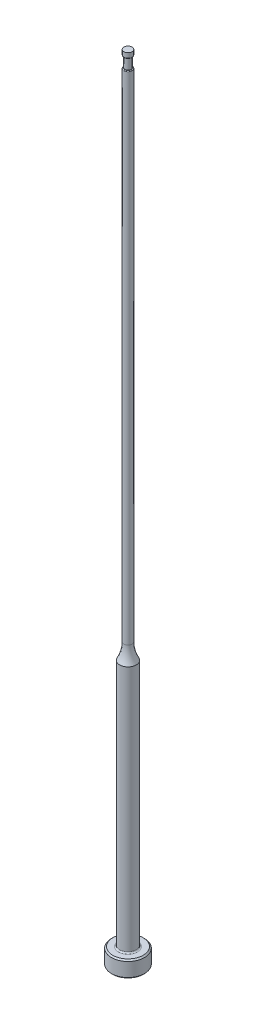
ISO-10303-21;
HEADER;
FILE_DESCRIPTION(('STEP AP214'),'2;1');
FILE_NAME('part.step','',(''),(''),'','','');
FILE_SCHEMA(('AUTOMOTIVE_DESIGN { 1 0 10303 214 1 1 1 1 }'));
ENDSEC;
DATA;
#1=APPLICATION_CONTEXT('core data for automotive mechanical design processes');
#2=APPLICATION_PROTOCOL_DEFINITION('international standard','automotive_design',2000,#1);
#3=PRODUCT_CONTEXT('',#1,'mechanical');
#4=PRODUCT('Part','Part','',(#3));
#5=PRODUCT_RELATED_PRODUCT_CATEGORY('part','',(#4));
#6=PRODUCT_DEFINITION_FORMATION('','',#4);
#7=PRODUCT_DEFINITION_CONTEXT('part definition',#1,'design');
#8=PRODUCT_DEFINITION('design','',#6,#7);
#9=PRODUCT_DEFINITION_SHAPE('','',#8);
#10=(LENGTH_UNIT() NAMED_UNIT(*) SI_UNIT(.MILLI.,.METRE.));
#11=(NAMED_UNIT(*) PLANE_ANGLE_UNIT() SI_UNIT($,.RADIAN.));
#12=(NAMED_UNIT(*) SI_UNIT($,.STERADIAN.) SOLID_ANGLE_UNIT());
#13=UNCERTAINTY_MEASURE_WITH_UNIT(LENGTH_MEASURE(1.E-05),#10,'distance_accuracy_value','');
#14=(GEOMETRIC_REPRESENTATION_CONTEXT(3) GLOBAL_UNCERTAINTY_ASSIGNED_CONTEXT((#13)) GLOBAL_UNIT_ASSIGNED_CONTEXT((#10,
#11,#12)) REPRESENTATION_CONTEXT('',''));
#15=CARTESIAN_POINT('',(0.,0.,0.));
#16=DIRECTION('',(0.,0.,1.));
#17=DIRECTION('',(1.,0.,0.));
#18=AXIS2_PLACEMENT_3D('',#15,#16,#17);
#19=CARTESIAN_POINT('',(-0.79374999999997,151.384,0.));
#20=DIRECTION('',(0.,1.,0.));
#21=DIRECTION('',(0.,0.,1.));
#22=AXIS2_PLACEMENT_3D('',#19,#20,#21);
#23=PLANE('',#22);
#24=CARTESIAN_POINT('',(0.,151.384,0.));
#25=DIRECTION('',(0.,1.,0.));
#26=DIRECTION('',(0.,0.,1.));
#27=AXIS2_PLACEMENT_3D('',#24,#25,#26);
#28=CIRCLE('',#27,0.66166999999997);
#29=CARTESIAN_POINT('',(0.,151.384,0.66166999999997));
#30=VERTEX_POINT('',#29);
#31=EDGE_CURVE('E11',#30,#30,#28,.F.);
#32=ORIENTED_EDGE('',*,*,#31,.T.);
#33=EDGE_LOOP('',(#32));
#34=FACE_BOUND('',#33,.T.);
#35=CARTESIAN_POINT('',(0.,151.384,0.));
#36=DIRECTION('',(0.,1.,0.));
#37=DIRECTION('',(0.,0.,1.));
#38=AXIS2_PLACEMENT_3D('',#35,#36,#37);
#39=CIRCLE('',#38,0.59054999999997);
#40=CARTESIAN_POINT('',(0.,151.384,0.59054999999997));
#41=VERTEX_POINT('',#40);
#42=EDGE_CURVE('E79',#41,#41,#39,.T.);
#43=ORIENTED_EDGE('',*,*,#42,.T.);
#44=EDGE_LOOP('',(#43));
#45=FACE_BOUND('',#44,.T.);
#46=ADVANCED_FACE('F37',(#34,#45),#23,.F.);
#47=CARTESIAN_POINT('',(0.,259.958771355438,0.));
#48=DIRECTION('',(0.,1.,0.));
#49=DIRECTION('',(0.,0.,1.));
#50=AXIS2_PLACEMENT_3D('',#47,#48,#49);
#51=CYLINDRICAL_SURFACE('',#50,0.79374999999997);
#52=DIRECTION('',(0.,1.,0.));
#53=VECTOR('',#52,1.);
#54=CARTESIAN_POINT('',(-0.590549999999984,259.958771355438,-0.530367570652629));
#55=LINE('',#54,#53);
#56=CARTESIAN_POINT('',(-0.590549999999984,149.225,-0.530367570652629));
#57=VERTEX_POINT('',#56);
#58=CARTESIAN_POINT('',(-0.590549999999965,112.268,-0.53036757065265));
#59=VERTEX_POINT('',#58);
#60=EDGE_CURVE('E74',#57,#59,#55,.F.);
#61=ORIENTED_EDGE('',*,*,#60,.F.);
#62=CARTESIAN_POINT('',(0.,149.225,0.));
#63=DIRECTION('',(0.,-1.,0.));
#64=DIRECTION('',(0.,0.,-1.));
#65=AXIS2_PLACEMENT_3D('',#62,#63,#64);
#66=CIRCLE('',#65,0.79374999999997);
#67=CARTESIAN_POINT('',(-0.590549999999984,149.225,0.530367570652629));
#68=VERTEX_POINT('',#67);
#69=EDGE_CURVE('E52',#57,#68,#66,.T.);
#70=ORIENTED_EDGE('',*,*,#69,.T.);
#71=DIRECTION('',(0.,1.,0.));
#72=VECTOR('',#71,1.);
#73=CARTESIAN_POINT('',(-0.590549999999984,259.958771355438,0.530367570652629));
#74=LINE('',#73,#72);
#75=CARTESIAN_POINT('',(-0.590549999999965,112.268,0.53036757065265));
#76=VERTEX_POINT('',#75);
#77=EDGE_CURVE('E85',#76,#68,#74,.T.);
#78=ORIENTED_EDGE('',*,*,#77,.F.);
#79=CARTESIAN_POINT('',(-0.590549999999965,112.268,-0.53036757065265));
#80=CARTESIAN_POINT('',(-0.590539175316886,112.212196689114,-0.530314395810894));
#81=CARTESIAN_POINT('',(-0.592020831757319,112.156372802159,-0.528725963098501));
#82=CARTESIAN_POINT('',(-0.597911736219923,112.044820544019,-0.522091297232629));
#83=CARTESIAN_POINT('',(-0.602334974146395,111.989093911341,-0.517028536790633));
#84=CARTESIAN_POINT('',(-0.614284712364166,111.876202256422,-0.502771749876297));
#85=CARTESIAN_POINT('',(-0.621928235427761,111.819068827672,-0.493420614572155));
#86=CARTESIAN_POINT('',(-0.640090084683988,111.706428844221,-0.469629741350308));
#87=CARTESIAN_POINT('',(-0.650601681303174,111.650918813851,-0.455201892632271));
#88=CARTESIAN_POINT('',(-0.672694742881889,111.548775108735,-0.421752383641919));
#89=CARTESIAN_POINT('',(-0.684015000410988,111.501853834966,-0.403447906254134));
#90=CARTESIAN_POINT('',(-0.707793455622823,111.411925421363,-0.360113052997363));
#91=CARTESIAN_POINT('',(-0.72023851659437,111.368882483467,-0.335155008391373));
#92=CARTESIAN_POINT('',(-0.738199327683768,111.310842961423,-0.292081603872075));
#93=CARTESIAN_POINT('',(-0.74383162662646,111.293242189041,-0.27753752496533));
#94=CARTESIAN_POINT('',(-0.754779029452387,111.259938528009,-0.246220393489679));
#95=CARTESIAN_POINT('',(-0.760093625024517,111.244238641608,-0.229443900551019));
#96=CARTESIAN_POINT('',(-0.77009609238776,111.215327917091,-0.193256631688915));
#97=CARTESIAN_POINT('',(-0.774774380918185,111.202154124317,-0.173812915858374));
#98=CARTESIAN_POINT('',(-0.7828791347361,111.179678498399,-0.13257215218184));
#99=CARTESIAN_POINT('',(-0.786309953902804,111.170363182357,-0.110783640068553));
#100=CARTESIAN_POINT('',(-0.790553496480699,111.158926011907,-0.0728220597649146));
#101=CARTESIAN_POINT('',(-0.791853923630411,111.155452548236,-0.057108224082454));
#102=CARTESIAN_POINT('',(-0.793506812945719,111.151044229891,-0.0252785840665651));
#103=CARTESIAN_POINT('',(-0.793859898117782,111.150107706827,-0.00916305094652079));
#104=CARTESIAN_POINT('',(-0.793579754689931,111.150852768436,0.0230049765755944));
#105=CARTESIAN_POINT('',(-0.792946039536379,111.152535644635,0.0390574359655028));
#106=CARTESIAN_POINT('',(-0.790759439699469,111.158380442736,0.0706385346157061));
#107=CARTESIAN_POINT('',(-0.789205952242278,111.162543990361,0.0861668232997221));
#108=CARTESIAN_POINT('',(-0.784847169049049,111.174343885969,0.120053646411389));
#109=CARTESIAN_POINT('',(-0.781828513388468,111.18258090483,0.138174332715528));
#110=CARTESIAN_POINT('',(-0.774926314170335,111.201745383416,0.172744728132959));
#111=CARTESIAN_POINT('',(-0.771041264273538,111.21267753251,0.189191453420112));
#112=CARTESIAN_POINT('',(-0.760742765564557,111.242279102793,0.227766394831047));
#113=CARTESIAN_POINT('',(-0.754005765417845,111.262155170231,0.24887506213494));
#114=CARTESIAN_POINT('',(-0.740079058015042,111.30484818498,0.287657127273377));
#115=CARTESIAN_POINT('',(-0.732888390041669,111.32767148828,0.305322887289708));
#116=CARTESIAN_POINT('',(-0.713188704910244,111.39302595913,0.349810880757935));
#117=CARTESIAN_POINT('',(-0.700707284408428,111.437575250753,0.373653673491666));
#118=CARTESIAN_POINT('',(-0.67715396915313,111.529937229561,0.414797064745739));
#119=CARTESIAN_POINT('',(-0.666086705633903,111.577759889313,0.432076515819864));
#120=CARTESIAN_POINT('',(-0.646811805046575,111.671193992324,0.460367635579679));
#121=CARTESIAN_POINT('',(-0.638441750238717,111.716651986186,0.471784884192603));
#122=CARTESIAN_POINT('',(-0.623612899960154,111.80862035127,0.491217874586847));
#123=CARTESIAN_POINT('',(-0.617155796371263,111.855131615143,0.499230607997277));
#124=CARTESIAN_POINT('',(-0.606291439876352,111.94873683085,0.512368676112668));
#125=CARTESIAN_POINT('',(-0.601882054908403,111.995830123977,0.517497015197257));
#126=CARTESIAN_POINT('',(-0.595168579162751,112.090371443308,0.525204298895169));
#127=CARTESIAN_POINT('',(-0.592864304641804,112.137819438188,0.527783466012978));
#128=CARTESIAN_POINT('',(-0.591267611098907,112.199102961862,0.529567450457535));
#129=CARTESIAN_POINT('',(-0.590998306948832,112.212891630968,0.529867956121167));
#130=CARTESIAN_POINT('',(-0.590639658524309,112.240453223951,0.530267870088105));
#131=CARTESIAN_POINT('',(-0.590550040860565,112.254226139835,0.530367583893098));
#132=CARTESIAN_POINT('',(-0.590549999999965,112.268,0.530367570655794));
#133=B_SPLINE_CURVE_WITH_KNOTS('',3,(#79,#80,#81,#82,#83,#84,#85,#86,#87,#88,#89,#90,#91,#92,
#93,#94,#95,#96,#97,#98,#99,#100,#101,#102,#103,#104,#105,#106,#107,#108,#109,#110,#111,#112,
#113,#114,#115,#116,#117,#118,#119,#120,#121,#122,#123,#124,#125,#126,#127,#128,#129,#130,#131,
#132),.UNSPECIFIED.,.F.,.F.,(4,2,2,2,2,2,2,2,2,2,2,2,2,2,2,2,2,2,2,2,2,2,2,2,2,2,4),(0.,
0.167401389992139,0.335604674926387,0.510534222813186,0.685056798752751,0.839551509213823,
0.99243073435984,1.0628421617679,1.13336338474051,1.20485071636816,1.27608609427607,
1.32431373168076,1.3725096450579,1.42072932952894,1.46898064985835,1.52904518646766,
1.5892149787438,1.67801053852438,1.76700089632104,1.9222687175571,2.07803266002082,
2.22066560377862,2.3634243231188,2.50603406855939,2.64863136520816,2.6900134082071,
2.73133244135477),.UNSPECIFIED.);
#134=EDGE_CURVE('E82',#59,#76,#133,.T.);
#135=ORIENTED_EDGE('',*,*,#134,.F.);
#136=EDGE_LOOP('',(#61,#70,#78,#135));
#137=FACE_BOUND('',#136,.T.);
#138=CARTESIAN_POINT('',(0.,53.8741805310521,0.));
#139=DIRECTION('',(0.,1.,0.));
#140=DIRECTION('',(0.,0.,1.));
#141=AXIS2_PLACEMENT_3D('',#138,#139,#140);
#142=CIRCLE('',#141,0.79374999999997);
#143=CARTESIAN_POINT('',(0.,53.8741805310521,0.79374999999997));
#144=VERTEX_POINT('',#143);
#145=EDGE_CURVE('E108',#144,#144,#142,.T.);
#146=ORIENTED_EDGE('',*,*,#145,.T.);
#147=EDGE_LOOP('',(#146));
#148=FACE_BOUND('',#147,.T.);
#149=ADVANCED_FACE('F83',(#137,#148),#51,.T.);
#150=CARTESIAN_POINT('',(0.,53.8741805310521,0.));
#151=DIRECTION('',(0.,1.,0.));
#152=DIRECTION('',(0.,0.,1.));
#153=AXIS2_PLACEMENT_3D('',#150,#151,#152);
#154=TOROIDAL_SURFACE('',#153,7.14374999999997,6.35);
#155=CARTESIAN_POINT('',(0.,50.8,0.));
#156=DIRECTION('',(0.,1.,0.));
#157=DIRECTION('',(0.,0.,1.));
#158=AXIS2_PLACEMENT_3D('',#155,#156,#157);
#159=CIRCLE('',#158,1.58749999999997);
#160=CARTESIAN_POINT('',(0.,50.8,1.58749999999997));
#161=VERTEX_POINT('',#160);
#162=EDGE_CURVE('E105',#161,#161,#159,.T.);
#163=ORIENTED_EDGE('',*,*,#162,.T.);
#164=EDGE_LOOP('',(#163));
#165=FACE_BOUND('',#164,.T.);
#166=ORIENTED_EDGE('',*,*,#145,.F.);
#167=EDGE_LOOP('',(#166));
#168=FACE_BOUND('',#167,.T.);
#169=ADVANCED_FACE('F172',(#165,#168),#154,.F.);
#170=CARTESIAN_POINT('',(0.,259.958771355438,0.));
#171=DIRECTION('',(0.,1.,0.));
#172=DIRECTION('',(0.,0.,1.));
#173=AXIS2_PLACEMENT_3D('',#170,#171,#172);
#174=CYLINDRICAL_SURFACE('',#173,1.58749999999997);
#175=CARTESIAN_POINT('',(0.,3.42900000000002,0.));
#176=DIRECTION('',(0.,1.,0.));
#177=DIRECTION('',(0.,0.,1.));
#178=AXIS2_PLACEMENT_3D('',#175,#176,#177);
#179=CIRCLE('',#178,1.58749999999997);
#180=CARTESIAN_POINT('',(0.,3.42900000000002,1.58749999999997));
#181=VERTEX_POINT('',#180);
#182=EDGE_CURVE('E123',#181,#181,#179,.T.);
#183=ORIENTED_EDGE('',*,*,#182,.T.);
#184=EDGE_LOOP('',(#183));
#185=FACE_BOUND('',#184,.T.);
#186=ORIENTED_EDGE('',*,*,#162,.F.);
#187=EDGE_LOOP('',(#186));
#188=FACE_BOUND('',#187,.T.);
#189=ADVANCED_FACE('F169',(#185,#188),#174,.T.);
#190=CARTESIAN_POINT('',(-3.17499999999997,3.175,0.));
#191=DIRECTION('',(0.,1.,0.));
#192=DIRECTION('',(0.,0.,1.));
#193=AXIS2_PLACEMENT_3D('',#190,#191,#192);
#194=PLANE('',#193);
#195=CARTESIAN_POINT('',(0.,3.175,0.));
#196=DIRECTION('',(0.,1.,0.));
#197=DIRECTION('',(0.,0.,1.));
#198=AXIS2_PLACEMENT_3D('',#195,#196,#197);
#199=CIRCLE('',#198,1.84149999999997);
#200=CARTESIAN_POINT('',(0.,3.175,1.84149999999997));
#201=VERTEX_POINT('',#200);
#202=EDGE_CURVE('E88',#201,#201,#199,.F.);
#203=ORIENTED_EDGE('',*,*,#202,.T.);
#204=EDGE_LOOP('',(#203));
#205=FACE_BOUND('',#204,.T.);
#206=CARTESIAN_POINT('',(0.,3.175,0.));
#207=DIRECTION('',(0.,1.,0.));
#208=DIRECTION('',(0.,0.,1.));
#209=AXIS2_PLACEMENT_3D('',#206,#207,#208);
#210=CIRCLE('',#209,2.92099999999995);
#211=CARTESIAN_POINT('',(0.,3.175,2.92099999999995));
#212=VERTEX_POINT('',#211);
#213=EDGE_CURVE('E111',#212,#212,#210,.T.);
#214=ORIENTED_EDGE('',*,*,#213,.T.);
#215=EDGE_LOOP('',(#214));
#216=FACE_BOUND('',#215,.T.);
#217=ADVANCED_FACE('F165',(#205,#216),#194,.T.);
#218=CARTESIAN_POINT('',(0.,259.958771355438,0.));
#219=DIRECTION('',(0.,1.,0.));
#220=DIRECTION('',(0.,0.,1.));
#221=AXIS2_PLACEMENT_3D('',#218,#219,#220);
#222=CYLINDRICAL_SURFACE('',#221,3.17499999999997);
#223=CARTESIAN_POINT('',(0.,2.92100000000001,0.));
#224=DIRECTION('',(0.,1.,0.));
#225=DIRECTION('',(0.,0.,1.));
#226=AXIS2_PLACEMENT_3D('',#223,#224,#225);
#227=CIRCLE('',#226,3.17499999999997);
#228=CARTESIAN_POINT('',(0.,2.92100000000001,3.17499999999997));
#229=VERTEX_POINT('',#228);
#230=EDGE_CURVE('E117',#229,#229,#227,.F.);
#231=ORIENTED_EDGE('',*,*,#230,.T.);
#232=EDGE_LOOP('',(#231));
#233=FACE_BOUND('',#232,.T.);
#234=CARTESIAN_POINT('',(0.,0.254000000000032,0.));
#235=DIRECTION('',(0.,-1.,0.));
#236=DIRECTION('',(0.,0.,-1.));
#237=AXIS2_PLACEMENT_3D('',#234,#235,#236);
#238=CIRCLE('',#237,3.17499999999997);
#239=CARTESIAN_POINT('',(0.,0.254000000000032,-3.17499999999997));
#240=VERTEX_POINT('',#239);
#241=EDGE_CURVE('E114',#240,#240,#238,.F.);
#242=ORIENTED_EDGE('',*,*,#241,.T.);
#243=EDGE_LOOP('',(#242));
#244=FACE_BOUND('',#243,.T.);
#245=ADVANCED_FACE('F161',(#233,#244),#222,.T.);
#246=CARTESIAN_POINT('',(0.,0.,0.));
#247=DIRECTION('',(0.,-1.,0.));
#248=DIRECTION('',(0.,0.,-1.));
#249=AXIS2_PLACEMENT_3D('',#246,#247,#248);
#250=PLANE('',#249);
#251=CARTESIAN_POINT('',(0.,0.,0.));
#252=DIRECTION('',(0.,-1.,0.));
#253=DIRECTION('',(0.,0.,-1.));
#254=AXIS2_PLACEMENT_3D('',#251,#252,#253);
#255=CIRCLE('',#254,2.92099999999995);
#256=CARTESIAN_POINT('',(0.,0.,-2.92099999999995));
#257=VERTEX_POINT('',#256);
#258=EDGE_CURVE('E120',#257,#257,#255,.T.);
#259=ORIENTED_EDGE('',*,*,#258,.T.);
#260=EDGE_LOOP('',(#259));
#261=FACE_BOUND('',#260,.T.);
#262=ADVANCED_FACE('F157',(#261),#250,.T.);
#263=CARTESIAN_POINT('',(0.,3.17499999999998,0.));
#264=DIRECTION('',(0.,-1.,0.));
#265=DIRECTION('',(0.,0.,-1.));
#266=AXIS2_PLACEMENT_3D('',#263,#264,#265);
#267=CONICAL_SURFACE('',#266,2.92099999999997,0.7853981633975);
#268=ORIENTED_EDGE('',*,*,#230,.F.);
#269=EDGE_LOOP('',(#268));
#270=FACE_BOUND('',#269,.T.);
#271=ORIENTED_EDGE('',*,*,#213,.F.);
#272=EDGE_LOOP('',(#271));
#273=FACE_BOUND('',#272,.T.);
#274=ADVANCED_FACE('F160',(#270,#273),#267,.T.);
#275=CARTESIAN_POINT('',(0.,0.254000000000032,0.));
#276=DIRECTION('',(0.,1.,0.));
#277=DIRECTION('',(0.,0.,1.));
#278=AXIS2_PLACEMENT_3D('',#275,#276,#277);
#279=CONICAL_SURFACE('',#278,3.17499999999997,0.785398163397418);
#280=ORIENTED_EDGE('',*,*,#258,.F.);
#281=EDGE_LOOP('',(#280));
#282=FACE_BOUND('',#281,.T.);
#283=ORIENTED_EDGE('',*,*,#241,.F.);
#284=EDGE_LOOP('',(#283));
#285=FACE_BOUND('',#284,.T.);
#286=ADVANCED_FACE('F229',(#282,#285),#279,.T.);
#287=CARTESIAN_POINT('',(0.,3.42900000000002,0.));
#288=DIRECTION('',(0.,1.,0.));
#289=DIRECTION('',(0.,0.,1.));
#290=AXIS2_PLACEMENT_3D('',#287,#288,#289);
#291=TOROIDAL_SURFACE('',#290,1.84149999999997,0.254);
#292=ORIENTED_EDGE('',*,*,#202,.F.);
#293=EDGE_LOOP('',(#292));
#294=FACE_BOUND('',#293,.T.);
#295=ORIENTED_EDGE('',*,*,#182,.F.);
#296=EDGE_LOOP('',(#295));
#297=FACE_BOUND('',#296,.T.);
#298=ADVANCED_FACE('F155',(#294,#297),#291,.F.);
#299=CARTESIAN_POINT('',(-0.79374999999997,149.352,0.));
#300=DIRECTION('',(0.,-1.,0.));
#301=DIRECTION('',(0.,0.,-1.));
#302=AXIS2_PLACEMENT_3D('',#299,#300,#301);
#303=PLANE('',#302);
#304=DIRECTION('',(0.,0.,1.));
#305=VECTOR('',#304,1.);
#306=CARTESIAN_POINT('',(-0.59054999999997,149.352,0.));
#307=LINE('',#306,#305);
#308=CARTESIAN_POINT('',(-0.59054999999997,149.352,0.));
#309=VERTEX_POINT('',#308);
#310=CARTESIAN_POINT('',(-0.59054999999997,149.352,0.309525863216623));
#311=VERTEX_POINT('',#310);
#312=EDGE_CURVE('E91',#309,#311,#307,.T.);
#313=ORIENTED_EDGE('',*,*,#312,.T.);
#314=CARTESIAN_POINT('',(0.,149.352,0.));
#315=DIRECTION('',(0.,-1.,0.));
#316=DIRECTION('',(0.,0.,-1.));
#317=AXIS2_PLACEMENT_3D('',#314,#315,#316);
#318=CIRCLE('',#317,0.66674999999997);
#319=CARTESIAN_POINT('',(-0.59054999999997,149.352,-0.309525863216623));
#320=VERTEX_POINT('',#319);
#321=EDGE_CURVE('E87',#311,#320,#318,.F.);
#322=ORIENTED_EDGE('',*,*,#321,.T.);
#323=EDGE_CURVE('E80',#320,#309,#307,.T.);
#324=ORIENTED_EDGE('',*,*,#323,.T.);
#325=CARTESIAN_POINT('',(0.,149.352,0.));
#326=DIRECTION('',(0.,1.,0.));
#327=DIRECTION('',(0.,0.,1.));
#328=AXIS2_PLACEMENT_3D('',#325,#326,#327);
#329=CIRCLE('',#328,0.59054999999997);
#330=EDGE_CURVE('E102',#309,#309,#329,.T.);
#331=ORIENTED_EDGE('',*,*,#330,.F.);
#332=EDGE_LOOP('',(#313,#322,#324,#331));
#333=FACE_BOUND('',#332,.T.);
#334=ADVANCED_FACE('F151',(#333),#303,.F.);
#335=CARTESIAN_POINT('',(0.,153.448281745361,0.));
#336=DIRECTION('',(0.,1.,0.));
#337=DIRECTION('',(0.,0.,1.));
#338=AXIS2_PLACEMENT_3D('',#335,#336,#337);
#339=CYLINDRICAL_SURFACE('',#338,0.59054999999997);
#340=ORIENTED_EDGE('',*,*,#42,.F.);
#341=EDGE_LOOP('',(#340));
#342=FACE_BOUND('',#341,.T.);
#343=ORIENTED_EDGE('',*,*,#330,.T.);
#344=EDGE_LOOP('',(#343));
#345=FACE_BOUND('',#344,.T.);
#346=ADVANCED_FACE('F148',(#342,#345),#339,.T.);
#347=CARTESIAN_POINT('',(-0.59054999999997,150.368,-3.17499999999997));
#348=DIRECTION('',(1.,0.,0.));
#349=DIRECTION('',(0.,1.,0.));
#350=AXIS2_PLACEMENT_3D('',#347,#348,#349);
#351=PLANE('',#350);
#352=ORIENTED_EDGE('',*,*,#323,.F.);
#353=CARTESIAN_POINT('',(-0.59054999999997,149.352,-0.309525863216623));
#354=CARTESIAN_POINT('',(-0.59054999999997,149.351996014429,-0.320154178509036));
#355=CARTESIAN_POINT('',(-0.59054999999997,149.351711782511,-0.330794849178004));
#356=CARTESIAN_POINT('',(-0.59054999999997,149.350412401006,-0.352104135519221));
#357=CARTESIAN_POINT('',(-0.59054999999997,149.349392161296,-0.362772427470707));
#358=CARTESIAN_POINT('',(-0.59054999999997,149.346423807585,-0.384147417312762));
#359=CARTESIAN_POINT('',(-0.59054999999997,149.344462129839,-0.394852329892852));
#360=CARTESIAN_POINT('',(-0.59054999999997,149.339396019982,-0.415965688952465));
#361=CARTESIAN_POINT('',(-0.59054999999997,149.33629522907,-0.426374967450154));
#362=CARTESIAN_POINT('',(-0.59054999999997,149.329886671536,-0.443512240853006));
#363=CARTESIAN_POINT('',(-0.59054999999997,149.326944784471,-0.450376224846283));
#364=CARTESIAN_POINT('',(-0.59054999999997,149.320316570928,-0.463725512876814));
#365=CARTESIAN_POINT('',(-0.59054999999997,149.316631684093,-0.470211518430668));
#366=CARTESIAN_POINT('',(-0.59054999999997,149.308387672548,-0.482700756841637));
#367=CARTESIAN_POINT('',(-0.59054999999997,149.303820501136,-0.488698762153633));
#368=CARTESIAN_POINT('',(-0.59054999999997,149.293766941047,-0.499879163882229));
#369=CARTESIAN_POINT('',(-0.59054999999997,149.288281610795,-0.505062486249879));
#370=CARTESIAN_POINT('',(-0.59054999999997,149.278008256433,-0.513019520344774));
#371=CARTESIAN_POINT('',(-0.59054999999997,149.273432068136,-0.516065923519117));
#372=CARTESIAN_POINT('',(-0.59054999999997,149.263852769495,-0.521376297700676));
#373=CARTESIAN_POINT('',(-0.59054999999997,149.258850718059,-0.523642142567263));
#374=CARTESIAN_POINT('',(-0.59054999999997,149.249098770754,-0.527042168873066));
#375=CARTESIAN_POINT('',(-0.59054999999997,149.244383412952,-0.528274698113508));
#376=CARTESIAN_POINT('',(-0.59054999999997,149.23478232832,-0.529944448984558));
#377=CARTESIAN_POINT('',(-0.59054999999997,149.22989566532,-0.530376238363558));
#378=CARTESIAN_POINT('',(-0.59054999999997,149.225,-0.530367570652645));
#379=B_SPLINE_CURVE_WITH_KNOTS('',3,(#353,#354,#355,#356,#357,#358,#359,#360,#361,#362,#363,
#364,#365,#366,#367,#368,#369,#370,#371,#372,#373,#374,#375,#376,#377,#378),.UNSPECIFIED.,.F.,
.F.,(4,2,2,2,2,2,2,2,2,2,2,2,4),(0.,0.0319002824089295,0.0640233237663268,0.096623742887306,
0.129120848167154,0.151487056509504,0.173810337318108,0.196347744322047,0.218859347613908,
0.235290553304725,0.25168203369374,0.266237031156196,0.280890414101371),.UNSPECIFIED.);
#380=EDGE_CURVE('E60',#320,#57,#379,.T.);
#381=ORIENTED_EDGE('',*,*,#380,.T.);
#382=ORIENTED_EDGE('',*,*,#60,.T.);
#383=DIRECTION('',(0.,0.,1.));
#384=VECTOR('',#383,1.);
#385=CARTESIAN_POINT('',(-0.590549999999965,112.268,-3.17499999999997));
#386=LINE('',#385,#384);
#387=EDGE_CURVE('E78',#59,#76,#386,.T.);
#388=ORIENTED_EDGE('',*,*,#387,.T.);
#389=ORIENTED_EDGE('',*,*,#77,.T.);
#390=CARTESIAN_POINT('',(-0.590549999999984,149.225,0.530367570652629));
#391=CARTESIAN_POINT('',(-0.590549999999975,149.230430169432,0.530380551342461));
#392=CARTESIAN_POINT('',(-0.590549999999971,149.235846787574,0.529847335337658));
#393=CARTESIAN_POINT('',(-0.590549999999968,149.246444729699,0.527800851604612));
#394=CARTESIAN_POINT('',(-0.590549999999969,149.251627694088,0.5262961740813));
#395=CARTESIAN_POINT('',(-0.59054999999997,149.261636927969,0.522420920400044));
#396=CARTESIAN_POINT('',(-0.59054999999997,149.266464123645,0.520052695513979));
#397=CARTESIAN_POINT('',(-0.59054999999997,149.275699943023,0.514595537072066));
#398=CARTESIAN_POINT('',(-0.59054999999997,149.280107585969,0.511504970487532));
#399=CARTESIAN_POINT('',(-0.59054999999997,149.290154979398,0.503374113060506));
#400=CARTESIAN_POINT('',(-0.59054999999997,149.295566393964,0.49805215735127));
#401=CARTESIAN_POINT('',(-0.59054999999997,149.30546695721,0.486619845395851));
#402=CARTESIAN_POINT('',(-0.59054999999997,149.309954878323,0.480508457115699));
#403=CARTESIAN_POINT('',(-0.59054999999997,149.320155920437,0.464496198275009));
#404=CARTESIAN_POINT('',(-0.59054999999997,149.325326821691,0.454252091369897));
#405=CARTESIAN_POINT('',(-0.59054999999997,149.33406747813,0.433065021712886));
#406=CARTESIAN_POINT('',(-0.59054999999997,149.337627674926,0.422118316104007));
#407=CARTESIAN_POINT('',(-0.59054999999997,149.344882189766,0.394326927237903));
#408=CARTESIAN_POINT('',(-0.59054999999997,149.347749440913,0.377275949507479));
#409=CARTESIAN_POINT('',(-0.59054999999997,149.351271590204,0.343282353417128));
#410=CARTESIAN_POINT('',(-0.59054999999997,149.351970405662,0.326344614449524));
#411=CARTESIAN_POINT('',(-0.59054999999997,149.352,0.309525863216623));
#412=B_SPLINE_CURVE_WITH_KNOTS('',3,(#390,#391,#392,#393,#394,#395,#396,#397,#398,#399,#400,
#401,#402,#403,#404,#405,#406,#407,#408,#409,#410,#411),.UNSPECIFIED.,.F.,.F.,(4,2,2,2,2,2,2,2,
2,2,4),(0.,0.0162429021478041,0.0323441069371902,0.0484017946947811,0.0644961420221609,
0.0871387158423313,0.109811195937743,0.144045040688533,0.178479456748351,0.230172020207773,
0.280810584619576),.UNSPECIFIED.);
#413=EDGE_CURVE('E351',#68,#311,#412,.T.);
#414=ORIENTED_EDGE('',*,*,#413,.T.);
#415=ORIENTED_EDGE('',*,*,#312,.F.);
#416=EDGE_LOOP('',(#352,#381,#382,#388,#389,#414,#415));
#417=FACE_BOUND('',#416,.T.);
#418=ADVANCED_FACE('F76',(#417),#351,.F.);
#419=CARTESIAN_POINT('',(-3.76554999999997,112.268,-3.17499999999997));
#420=DIRECTION('',(0.,0.,1.));
#421=DIRECTION('',(1.,0.,0.));
#422=AXIS2_PLACEMENT_3D('',#419,#420,#421);
#423=CYLINDRICAL_SURFACE('',#422,3.175);
#424=ORIENTED_EDGE('',*,*,#387,.F.);
#425=ORIENTED_EDGE('',*,*,#134,.T.);
#426=EDGE_LOOP('',(#424,#425));
#427=FACE_BOUND('',#426,.T.);
#428=ADVANCED_FACE('F90',(#427),#423,.F.);
#429=CARTESIAN_POINT('',(0.,152.687735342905,0.));
#430=DIRECTION('',(0.,1.,0.));
#431=DIRECTION('',(0.,0.,1.));
#432=AXIS2_PLACEMENT_3D('',#429,#430,#431);
#433=CYLINDRICAL_SURFACE('',#432,0.78866999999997);
#434=CARTESIAN_POINT('',(0.,151.511,0.));
#435=DIRECTION('',(0.,1.,0.));
#436=DIRECTION('',(0.,0.,1.));
#437=AXIS2_PLACEMENT_3D('',#434,#435,#436);
#438=CIRCLE('',#437,0.78866999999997);
#439=CARTESIAN_POINT('',(0.,151.511,0.78866999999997));
#440=VERTEX_POINT('',#439);
#441=EDGE_CURVE('E45',#440,#440,#438,.T.);
#442=ORIENTED_EDGE('',*,*,#441,.T.);
#443=EDGE_LOOP('',(#442));
#444=FACE_BOUND('',#443,.T.);
#445=CARTESIAN_POINT('',(0.,152.4,0.));
#446=DIRECTION('',(0.,1.,0.));
#447=DIRECTION('',(0.,0.,1.));
#448=AXIS2_PLACEMENT_3D('',#445,#446,#447);
#449=CIRCLE('',#448,0.78866999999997);
#450=CARTESIAN_POINT('',(0.,152.4,0.78866999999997));
#451=VERTEX_POINT('',#450);
#452=EDGE_CURVE('E92',#451,#451,#449,.T.);
#453=ORIENTED_EDGE('',*,*,#452,.F.);
#454=EDGE_LOOP('',(#453));
#455=FACE_BOUND('',#454,.T.);
#456=ADVANCED_FACE('F142',(#444,#455),#433,.T.);
#457=CARTESIAN_POINT('',(-0.79374999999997,152.4,0.));
#458=DIRECTION('',(0.,1.,0.));
#459=DIRECTION('',(0.,0.,1.));
#460=AXIS2_PLACEMENT_3D('',#457,#458,#459);
#461=PLANE('',#460);
#462=ORIENTED_EDGE('',*,*,#452,.T.);
#463=EDGE_LOOP('',(#462));
#464=FACE_BOUND('',#463,.T.);
#465=ADVANCED_FACE('F197',(#464),#461,.T.);
#466=CARTESIAN_POINT('',(0.,149.225,0.));
#467=DIRECTION('',(0.,-1.,0.));
#468=DIRECTION('',(0.,0.,-1.));
#469=AXIS2_PLACEMENT_3D('',#466,#467,#468);
#470=TOROIDAL_SURFACE('',#469,0.66674999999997,0.127);
#471=ORIENTED_EDGE('',*,*,#413,.F.);
#472=ORIENTED_EDGE('',*,*,#69,.F.);
#473=ORIENTED_EDGE('',*,*,#380,.F.);
#474=ORIENTED_EDGE('',*,*,#321,.F.);
#475=EDGE_LOOP('',(#471,#472,#473,#474));
#476=FACE_BOUND('',#475,.T.);
#477=ADVANCED_FACE('F201',(#476),#470,.T.);
#478=CARTESIAN_POINT('',(0.,151.511,0.));
#479=DIRECTION('',(0.,1.,0.));
#480=DIRECTION('',(0.,0.,1.));
#481=AXIS2_PLACEMENT_3D('',#478,#479,#480);
#482=TOROIDAL_SURFACE('',#481,0.66166999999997,0.127);
#483=ORIENTED_EDGE('',*,*,#31,.F.);
#484=EDGE_LOOP('',(#483));
#485=FACE_BOUND('',#484,.T.);
#486=ORIENTED_EDGE('',*,*,#441,.F.);
#487=EDGE_LOOP('',(#486));
#488=FACE_BOUND('',#487,.T.);
#489=ADVANCED_FACE('F39',(#485,#488),#482,.T.);
#490=CLOSED_SHELL('',(#46,#149,#169,#189,#217,#245,#262,#274,#286,#298,#334,#346,#418,#428,#456,
#465,#477,#489));
#491=MANIFOLD_SOLID_BREP('B2',#490);
#492=ADVANCED_BREP_SHAPE_REPRESENTATION('',(#18,#491),#14);
#493=SHAPE_DEFINITION_REPRESENTATION(#9,#492);
ENDSEC;
END-ISO-10303-21;
